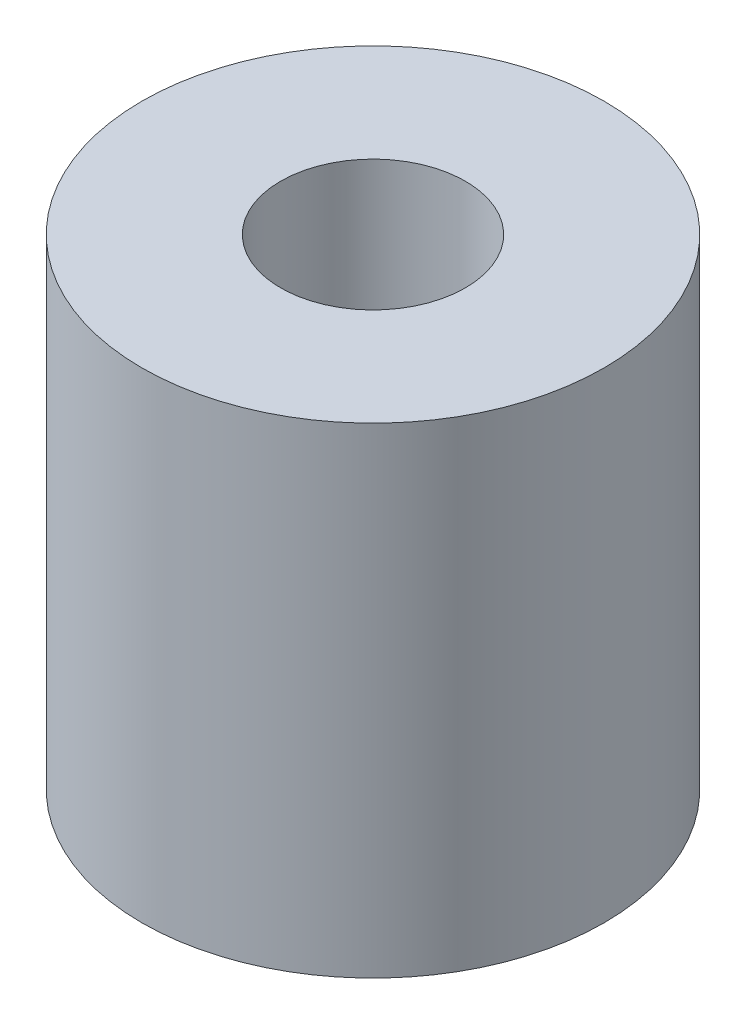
from build123d import *


with BuildPart() as part:
    # Skica1 → Z_klad-Rota_n (revolve)
    with BuildSketch(Plane.XY, mode=Mode.PRIVATE) as z_klad_rota_n_sk:
        Polygon((0, 5.2), (0, 2), (2.5, 2), (2.5, 7.2), (1, 7.2), (1, 5.2), align=None)
    revolve(z_klad_rota_n_sk.sketch.rotate(Axis((0, 5.2, 0), (0, -1, 0)), 180), axis=Axis((0, 5.2, 0), (0, -1, 0)))


solid = part.part
